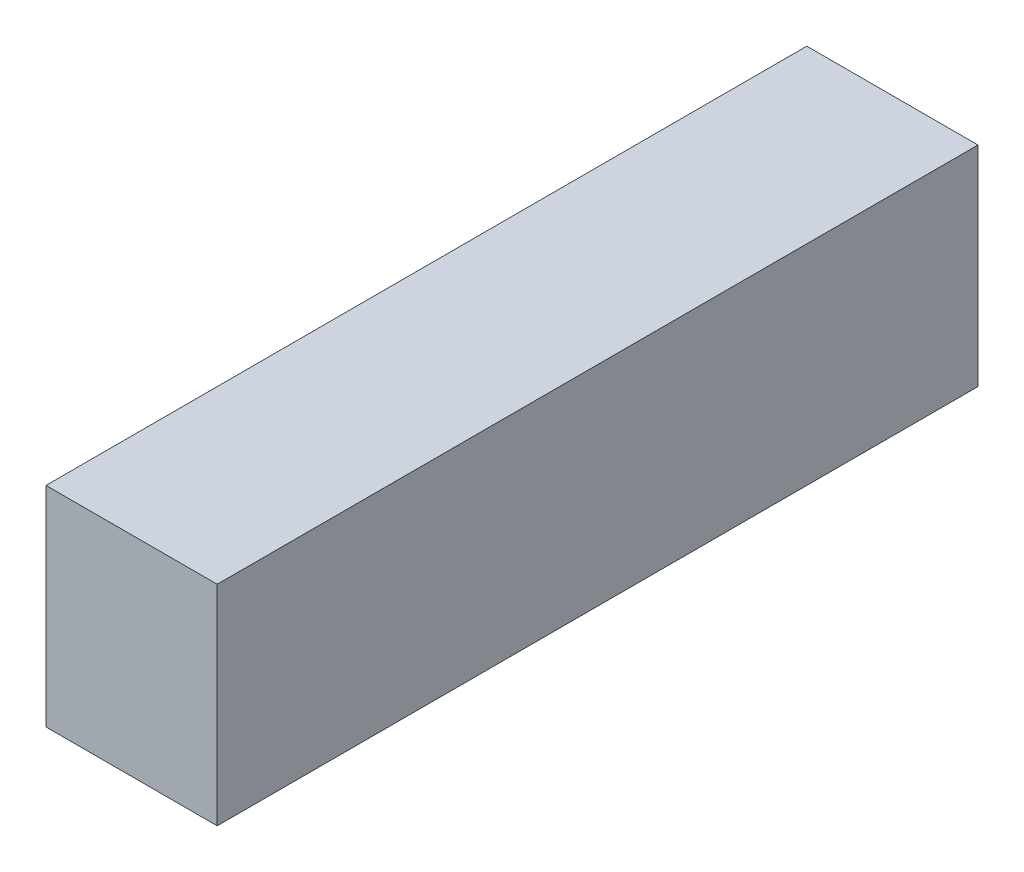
from build123d import *

# Parameters (mm, degrees)
SKETCH1_W           = 114.3
SKETCH1_H           = 139.7
BOSS_EXTRUDE1_DEPTH = 508


with BuildPart() as part:
    # Sketch1 → Boss-Extrude1 (new body)
    with BuildSketch(Plane.XY):
        with Locations((57.15, 69.85)):
            Rectangle(SKETCH1_W, SKETCH1_H)
    extrude(amount=BOSS_EXTRUDE1_DEPTH)


solid = part.part
